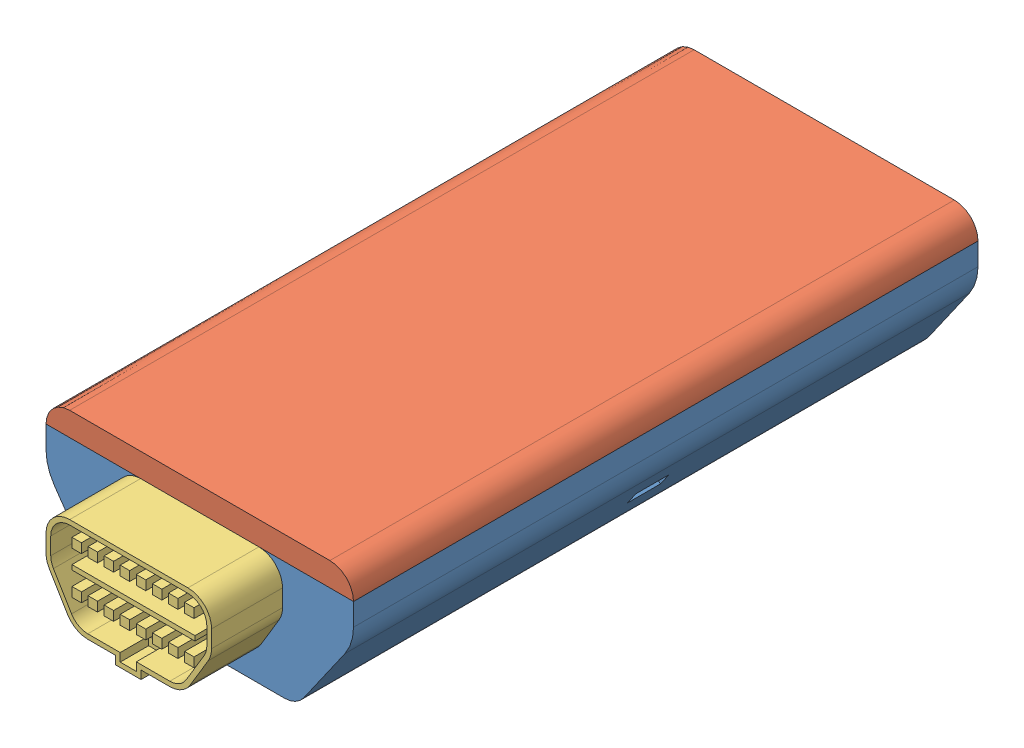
SolidWorks assembly ODB 2 Assembly (Simplified).SLDASM, configuration Default (file format 11000). Lengths in mm.
Overall size (65 30 149.5).
3 component instances, 3 part files, 6 mates.
Components (placement in the parent):
- ODB 2 Body-1: ODB 2 Body.SLDPRT [Default] at (22.8366 91.2698 103.3606) size (65 25 134.5)
- ODB 2 Body Top-1: ODB 2 Body Top.SLDPRT [Default] at (22.8366 91.2698 103.3606) size (65 5 132)
- ODB 2 Pin Connector-1: ODB 2 Pin Connector.SLDPRT [Default] at (37.8366 96.2698 235.3606) size (35 21.75 15)
Mates (geometry in assembly coordinates):
- Coincident4: coincident: plane of ODB 2 Body-1 through (22.8366 91.2698 235.3606) normal (0 0 1); plane of ODB 2 Body Top-1 through (22.8366 91.2698 235.3606) normal (0 0 1)
- Coincident12: coincident: line of ODB 2 Body-1 through (22.8366 116.2698 235.3606) axis (0 0 -1); line of ODB 2 Body Top-1 through (22.8366 116.2698 235.3606) axis (0 0 -1)
- Coincident15: coincident: line of ODB 2 Body-1 through (87.8366 116.2698 103.3606) axis (0 0 1); line of ODB 2 Body Top-1 through (87.8366 116.2698 103.3606) axis (0 0 1)
- Coincident16: coincident: plane of ODB 2 Body-1 through (22.8366 91.2698 235.3606) normal (0 0 1); plane of ODB 2 Pin Connector-1 through (37.8366 96.2698 235.3606) normal (0 0 -1)
- Distance3: distance = 5 mm: plane of ODB 2 Pin Connector-1 through (37.8366 116.2698 250.3606) normal (0 1 0); plane of ODB 2 Body Top-1 through (22.8366 121.2698 235.3606) normal (0 1 0)
- Distance4: distance = 15 mm: plane of ODB 2 Pin Connector-1 through (72.8366 96.2698 250.3606) normal (1 0 0); plane of ODB 2 Body-1 through (87.8366 91.2698 235.3606) normal (1 0 0)
